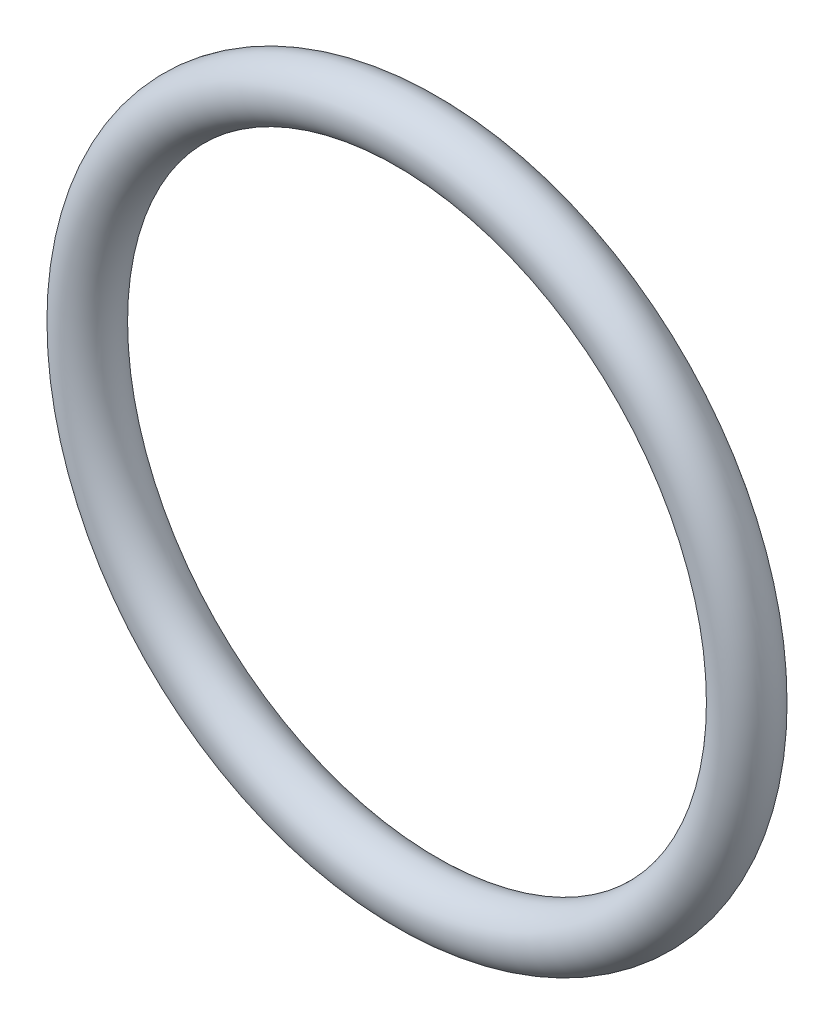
from build123d import *

# Parameters (mm, degrees)
SKETCH1_R = 0.889


with BuildPart() as part:
    # Sketch1 → Revolve1 (revolve)
    with BuildSketch(Plane(origin=(0, 0, 0), x_dir=(0, -1, 0), z_dir=(1, 0, 0)), mode=Mode.PRIVATE) as revolve1_sk:
        with Locations((10.2743, 0)):
            Circle(SKETCH1_R)
    revolve(revolve1_sk.sketch.rotate(Axis((0, 0, 0.889), (0, 0, -1)), 270), axis=Axis((0, 0, 0.889), (0, 0, -1)))


solid = part.part
